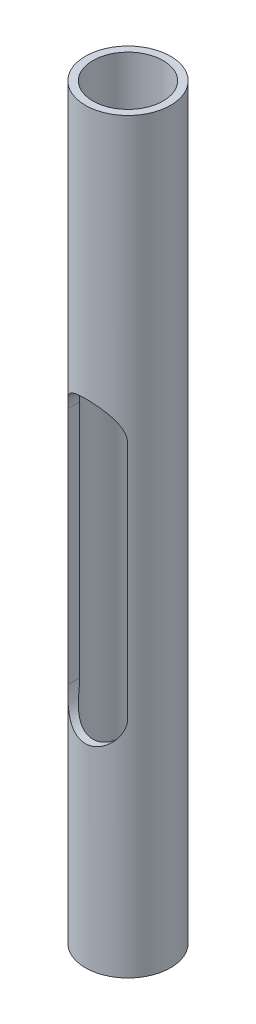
ISO-10303-21;
HEADER;
FILE_DESCRIPTION(('STEP AP214'),'2;1');
FILE_NAME('part.step','',(''),(''),'','','');
FILE_SCHEMA(('AUTOMOTIVE_DESIGN { 1 0 10303 214 1 1 1 1 }'));
ENDSEC;
DATA;
#1=APPLICATION_CONTEXT('core data for automotive mechanical design processes');
#2=APPLICATION_PROTOCOL_DEFINITION('international standard','automotive_design',2000,#1);
#3=PRODUCT_CONTEXT('',#1,'mechanical');
#4=PRODUCT('Part','Part','',(#3));
#5=PRODUCT_RELATED_PRODUCT_CATEGORY('part','',(#4));
#6=PRODUCT_DEFINITION_FORMATION('','',#4);
#7=PRODUCT_DEFINITION_CONTEXT('part definition',#1,'design');
#8=PRODUCT_DEFINITION('design','',#6,#7);
#9=PRODUCT_DEFINITION_SHAPE('','',#8);
#10=(LENGTH_UNIT() NAMED_UNIT(*) SI_UNIT(.MILLI.,.METRE.));
#11=(NAMED_UNIT(*) PLANE_ANGLE_UNIT() SI_UNIT($,.RADIAN.));
#12=(NAMED_UNIT(*) SI_UNIT($,.STERADIAN.) SOLID_ANGLE_UNIT());
#13=UNCERTAINTY_MEASURE_WITH_UNIT(LENGTH_MEASURE(1.E-05),#10,'distance_accuracy_value','');
#14=(GEOMETRIC_REPRESENTATION_CONTEXT(3) GLOBAL_UNCERTAINTY_ASSIGNED_CONTEXT((#13)) GLOBAL_UNIT_ASSIGNED_CONTEXT((#10,
#11,#12)) REPRESENTATION_CONTEXT('',''));
#15=CARTESIAN_POINT('',(0.,0.,0.));
#16=DIRECTION('',(0.,0.,1.));
#17=DIRECTION('',(1.,0.,0.));
#18=AXIS2_PLACEMENT_3D('',#15,#16,#17);
#19=CARTESIAN_POINT('',(0.,1000.,0.));
#20=DIRECTION('',(0.,-1.,0.));
#21=DIRECTION('',(0.,0.,-1.));
#22=AXIS2_PLACEMENT_3D('',#19,#20,#21);
#23=CYLINDRICAL_SURFACE('',#22,57.);
#24=CARTESIAN_POINT('',(0.,0.,0.));
#25=DIRECTION('',(0.,1.,0.));
#26=DIRECTION('',(0.,0.,1.));
#27=AXIS2_PLACEMENT_3D('',#24,#25,#26);
#28=CIRCLE('',#27,57.);
#29=CARTESIAN_POINT('',(0.,0.,57.));
#30=VERTEX_POINT('',#29);
#31=EDGE_CURVE('E36',#30,#30,#28,.T.);
#32=ORIENTED_EDGE('',*,*,#31,.T.);
#33=EDGE_LOOP('',(#32));
#34=FACE_BOUND('',#33,.T.);
#35=CARTESIAN_POINT('',(0.,1000.,0.));
#36=DIRECTION('',(0.,1.,0.));
#37=DIRECTION('',(0.,0.,1.));
#38=AXIS2_PLACEMENT_3D('',#35,#36,#37);
#39=CIRCLE('',#38,57.);
#40=CARTESIAN_POINT('',(0.,1000.,57.));
#41=VERTEX_POINT('',#40);
#42=EDGE_CURVE('E11',#41,#41,#39,.T.);
#43=ORIENTED_EDGE('',*,*,#42,.F.);
#44=EDGE_LOOP('',(#43));
#45=FACE_BOUND('',#44,.T.);
#46=CARTESIAN_POINT('',(-40.,620.,40.6078810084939));
#47=CARTESIAN_POINT('',(-40.0000187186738,620.483392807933,40.6078393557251));
#48=CARTESIAN_POINT('',(-39.9912379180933,620.966768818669,40.6165113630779));
#49=CARTESIAN_POINT('',(-39.9562189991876,621.932219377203,40.6509737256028));
#50=CARTESIAN_POINT('',(-39.9299830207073,622.414294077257,40.6767619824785));
#51=CARTESIAN_POINT('',(-39.860250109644,623.375239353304,40.7450944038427));
#52=CARTESIAN_POINT('',(-39.8167803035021,623.854113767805,40.7876122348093));
#53=CARTESIAN_POINT('',(-39.7128568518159,624.808265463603,40.8888030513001));
#54=CARTESIAN_POINT('',(-39.6524028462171,625.28354266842,40.9474763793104));
#55=CARTESIAN_POINT('',(-39.4475653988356,626.691955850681,41.1451803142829));
#56=CARTESIAN_POINT('',(-39.2789000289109,627.61858839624,41.3067025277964));
#57=CARTESIAN_POINT('',(-38.8796024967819,629.447415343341,41.6827454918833));
#58=CARTESIAN_POINT('',(-38.6489482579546,630.349600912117,41.8972851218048));
#59=CARTESIAN_POINT('',(-38.1309075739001,632.119350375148,42.369278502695));
#60=CARTESIAN_POINT('',(-37.8438853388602,632.987095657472,42.6264551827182));
#61=CARTESIAN_POINT('',(-37.2155911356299,634.690964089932,43.1760796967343));
#62=CARTESIAN_POINT('',(-36.8743227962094,635.527089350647,43.4685251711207));
#63=CARTESIAN_POINT('',(-36.1393390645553,637.168555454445,44.0814901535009));
#64=CARTESIAN_POINT('',(-35.745469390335,637.97379641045,44.4020912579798));
#65=CARTESIAN_POINT('',(-34.9084548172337,639.549836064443,45.0631142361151));
#66=CARTESIAN_POINT('',(-34.4653029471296,640.320629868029,45.403538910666));
#67=CARTESIAN_POINT('',(-33.4500380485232,641.958566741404,46.1580072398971));
#68=CARTESIAN_POINT('',(-32.8689226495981,642.819003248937,46.5745186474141));
#69=CARTESIAN_POINT('',(-31.6437412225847,644.489729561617,47.4154606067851));
#70=CARTESIAN_POINT('',(-30.9996706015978,645.300015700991,47.839891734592));
#71=CARTESIAN_POINT('',(-29.6500849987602,646.869009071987,48.6878615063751));
#72=CARTESIAN_POINT('',(-28.9445410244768,647.627691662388,49.1113996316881));
#73=CARTESIAN_POINT('',(-27.4738156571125,649.090638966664,49.949031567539));
#74=CARTESIAN_POINT('',(-26.7086301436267,649.794899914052,50.363124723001));
#75=CARTESIAN_POINT('',(-24.9864198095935,651.259605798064,51.2422113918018));
#76=CARTESIAN_POINT('',(-24.0187887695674,652.009540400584,51.7040334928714));
#77=CARTESIAN_POINT('',(-22.0071335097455,653.424506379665,52.5917692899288));
#78=CARTESIAN_POINT('',(-20.9630951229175,654.089521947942,53.0176762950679));
#79=CARTESIAN_POINT('',(-19.3446920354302,655.016697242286,53.6200919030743));
#80=CARTESIAN_POINT('',(-18.7968250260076,655.31388262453,53.8147230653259));
#81=CARTESIAN_POINT('',(-17.6841574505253,655.883995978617,54.1905449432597));
#82=CARTESIAN_POINT('',(-17.1193593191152,656.156927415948,54.3717375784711));
#83=CARTESIAN_POINT('',(-15.9738941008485,656.677381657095,54.7192179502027));
#84=CARTESIAN_POINT('',(-15.393231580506,656.924911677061,54.8855099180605));
#85=CARTESIAN_POINT('',(-14.2170853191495,657.393518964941,55.2018605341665));
#86=CARTESIAN_POINT('',(-13.6216029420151,657.614598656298,55.3519206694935));
#87=CARTESIAN_POINT('',(-12.1405785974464,658.124394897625,55.6993746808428));
#88=CARTESIAN_POINT('',(-11.2472931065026,658.39761270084,55.8869021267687));
#89=CARTESIAN_POINT('',(-9.43677619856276,658.882198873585,56.2209445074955));
#90=CARTESIAN_POINT('',(-8.51954905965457,659.093578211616,56.3674667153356));
#91=CARTESIAN_POINT('',(-6.6672418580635,659.451704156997,56.6164320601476));
#92=CARTESIAN_POINT('',(-5.73217395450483,659.598493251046,56.7189041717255));
#93=CARTESIAN_POINT('',(-3.85005162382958,659.825564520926,56.8776668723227));
#94=CARTESIAN_POINT('',(-2.90299679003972,659.905844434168,56.9339558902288));
#95=CARTESIAN_POINT('',(-1.0020499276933,659.998790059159,56.9991412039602));
#96=CARTESIAN_POINT('',(-0.0481480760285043,660.011321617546,57.0079434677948));
#97=CARTESIAN_POINT('',(1.8573422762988,659.968218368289,56.9776995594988));
#98=CARTESIAN_POINT('',(2.80893078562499,659.912583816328,56.9386535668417));
#99=CARTESIAN_POINT('',(4.70284822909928,659.733967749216,56.813591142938));
#100=CARTESIAN_POINT('',(5.64517492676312,659.610970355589,56.7275636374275));
#101=CARTESIAN_POINT('',(7.51360958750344,659.299398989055,56.5104440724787));
#102=CARTESIAN_POINT('',(8.43971754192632,659.110824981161,56.3793519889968));
#103=CARTESIAN_POINT('',(10.2483153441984,658.67579277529,56.0784529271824));
#104=CARTESIAN_POINT('',(11.1313187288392,658.430787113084,55.9096201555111));
#105=CARTESIAN_POINT('',(12.8712494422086,657.883541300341,55.5348804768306));
#106=CARTESIAN_POINT('',(13.7281773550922,657.581302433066,55.3289744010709));
#107=CARTESIAN_POINT('',(15.4120264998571,656.922714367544,54.8837676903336));
#108=CARTESIAN_POINT('',(16.2389459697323,656.566361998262,54.644465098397));
#109=CARTESIAN_POINT('',(17.8595627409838,655.802773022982,54.1364693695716));
#110=CARTESIAN_POINT('',(18.6532580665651,655.395533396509,53.8677744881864));
#111=CARTESIAN_POINT('',(20.2919590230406,654.484935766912,53.2736209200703));
#112=CARTESIAN_POINT('',(21.1327384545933,653.975920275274,52.9451756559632));
#113=CARTESIAN_POINT('',(22.7675461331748,652.902813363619,52.2630227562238));
#114=CARTESIAN_POINT('',(23.5615714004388,652.338718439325,51.9093135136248));
#115=CARTESIAN_POINT('',(25.1016839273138,651.158427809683,51.1823330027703));
#116=CARTESIAN_POINT('',(25.8477260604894,650.542184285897,50.8090439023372));
#117=CARTESIAN_POINT('',(27.289618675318,649.261014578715,50.0493845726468));
#118=CARTESIAN_POINT('',(27.9854667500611,648.596086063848,49.6630137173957));
#119=CARTESIAN_POINT('',(29.4459124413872,647.096520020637,48.8136632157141));
#120=CARTESIAN_POINT('',(30.2004737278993,646.252827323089,48.3493663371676));
#121=CARTESIAN_POINT('',(31.6360612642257,644.50387607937,47.4224611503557));
#122=CARTESIAN_POINT('',(32.3170722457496,643.598604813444,46.9598532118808));
#123=CARTESIAN_POINT('',(33.6029282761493,641.728578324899,46.0484987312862));
#124=CARTESIAN_POINT('',(34.2077604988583,640.763813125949,45.5997545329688));
#125=CARTESIAN_POINT('',(35.3374609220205,638.776826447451,44.7299868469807));
#126=CARTESIAN_POINT('',(35.8623544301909,637.754623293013,44.3089546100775));
#127=CARTESIAN_POINT('',(36.7162835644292,635.8967089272,43.6021477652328));
#128=CARTESIAN_POINT('',(37.0625860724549,635.072263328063,43.3075538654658));
#129=CARTESIAN_POINT('',(37.702293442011,633.391973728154,42.7518023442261));
#130=CARTESIAN_POINT('',(37.9956986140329,632.536129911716,42.4906445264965));
#131=CARTESIAN_POINT('',(38.5254559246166,630.798670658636,42.010911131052));
#132=CARTESIAN_POINT('',(38.7620006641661,629.917153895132,41.7921923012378));
#133=CARTESIAN_POINT('',(39.175864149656,628.129708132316,41.404497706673));
#134=CARTESIAN_POINT('',(39.353208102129,627.22378970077,41.2355007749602));
#135=CARTESIAN_POINT('',(39.5818880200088,625.792080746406,41.0156922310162));
#136=CARTESIAN_POINT('',(39.6544674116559,625.272531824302,40.9454608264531));
#137=CARTESIAN_POINT('',(39.7793024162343,624.228847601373,40.8241925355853));
#138=CARTESIAN_POINT('',(39.8315627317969,623.704713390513,40.7731512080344));
#139=CARTESIAN_POINT('',(39.9155352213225,622.651415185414,40.6909535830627));
#140=CARTESIAN_POINT('',(39.9471758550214,622.122240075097,40.6598665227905));
#141=CARTESIAN_POINT('',(39.9894258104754,621.062051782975,40.6182960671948));
#142=CARTESIAN_POINT('',(40.0000273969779,620.53103799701,40.6078202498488));
#143=CARTESIAN_POINT('',(40.,620.,40.6078810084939));
#144=B_SPLINE_CURVE_WITH_KNOTS('',3,(#46,#47,#48,#49,#50,#51,#52,#53,#54,#55,#56,#57,#58,#59,
#60,#61,#62,#63,#64,#65,#66,#67,#68,#69,#70,#71,#72,#73,#74,#75,#76,#77,#78,#79,#80,#81,#82,#83,
#84,#85,#86,#87,#88,#89,#90,#91,#92,#93,#94,#95,#96,#97,#98,#99,#100,#101,#102,#103,#104,#105,
#106,#107,#108,#109,#110,#111,#112,#113,#114,#115,#116,#117,#118,#119,#120,#121,#122,#123,#124,
#125,#126,#127,#128,#129,#130,#131,#132,#133,#134,#135,#136,#137,#138,#139,#140,#141,#142,#143),
.UNSPECIFIED.,.F.,.F.,(4,2,2,2,2,2,2,2,2,2,2,2,2,2,2,2,2,2,2,2,2,2,2,2,2,2,2,2,2,2,2,2,2,2,2,2,
2,2,2,2,2,2,2,2,2,2,2,2,4),(0.,1.44999242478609,2.89980712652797,4.34734878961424,
5.79492114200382,8.65728056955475,11.5206607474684,14.3661148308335,17.2113786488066,
20.065178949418,22.9193834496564,26.2724497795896,29.6257609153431,32.9806622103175,
36.3357954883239,40.2559312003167,44.1767956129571,46.1350119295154,48.0929479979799,
50.0503262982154,52.0075251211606,54.8625974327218,57.7171630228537,60.5698480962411,
63.4226302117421,66.2810592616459,69.1394775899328,71.9985699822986,74.8576639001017,
77.6500783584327,80.4424302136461,83.234945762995,86.0276271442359,89.1334603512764,
92.2394912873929,95.3484018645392,98.4574614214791,102.123849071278,105.790996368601,
109.458760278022,113.12536058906,115.947555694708,118.769734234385,121.582214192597,
124.393495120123,125.980665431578,127.567468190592,129.159747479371,130.752612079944),.UNSPECIFIED.);
#145=CARTESIAN_POINT('',(-40.0000000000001,620.,40.6078810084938));
#146=VERTEX_POINT('',#145);
#147=CARTESIAN_POINT('',(40.,620.,40.607881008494));
#148=VERTEX_POINT('',#147);
#149=EDGE_CURVE('E127',#146,#148,#144,.T.);
#150=ORIENTED_EDGE('',*,*,#149,.T.);
#151=DIRECTION('',(0.,-1.,0.));
#152=VECTOR('',#151,1.);
#153=CARTESIAN_POINT('',(40.,1000.,40.607881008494));
#154=LINE('',#153,#152);
#155=CARTESIAN_POINT('',(40.,300.,40.607881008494));
#156=VERTEX_POINT('',#155);
#157=EDGE_CURVE('E88',#148,#156,#154,.T.);
#158=ORIENTED_EDGE('',*,*,#157,.T.);
#159=CARTESIAN_POINT('',(40.,300.,40.6078810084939));
#160=CARTESIAN_POINT('',(40.0000187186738,299.516607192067,40.6078393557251));
#161=CARTESIAN_POINT('',(39.9912379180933,299.033231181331,40.6165113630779));
#162=CARTESIAN_POINT('',(39.9562189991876,298.067780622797,40.6509737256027));
#163=CARTESIAN_POINT('',(39.9299830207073,297.585705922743,40.6767619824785));
#164=CARTESIAN_POINT('',(39.860250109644,296.624760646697,40.7450944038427));
#165=CARTESIAN_POINT('',(39.8167803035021,296.145886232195,40.7876122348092));
#166=CARTESIAN_POINT('',(39.7128568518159,295.191734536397,40.8888030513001));
#167=CARTESIAN_POINT('',(39.6524028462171,294.71645733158,40.9474763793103));
#168=CARTESIAN_POINT('',(39.4475653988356,293.30804414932,41.1451803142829));
#169=CARTESIAN_POINT('',(39.2789000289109,292.38141160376,41.3067025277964));
#170=CARTESIAN_POINT('',(38.8796024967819,290.552584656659,41.6827454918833));
#171=CARTESIAN_POINT('',(38.6489482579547,289.650399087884,41.8972851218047));
#172=CARTESIAN_POINT('',(38.1309075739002,287.880649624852,42.3692785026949));
#173=CARTESIAN_POINT('',(37.8438853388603,287.012904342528,42.6264551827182));
#174=CARTESIAN_POINT('',(37.21559113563,285.309035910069,43.1760796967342));
#175=CARTESIAN_POINT('',(36.8743227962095,284.472910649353,43.4685251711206));
#176=CARTESIAN_POINT('',(36.1393390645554,282.831444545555,44.0814901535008));
#177=CARTESIAN_POINT('',(35.7454693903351,282.026203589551,44.4020912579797));
#178=CARTESIAN_POINT('',(34.9084548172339,280.450163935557,45.0631142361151));
#179=CARTESIAN_POINT('',(34.4653029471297,279.679370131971,45.4035389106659));
#180=CARTESIAN_POINT('',(33.4500380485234,278.041433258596,46.158007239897));
#181=CARTESIAN_POINT('',(32.8689226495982,277.180996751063,46.5745186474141));
#182=CARTESIAN_POINT('',(31.6437412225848,275.510270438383,47.4154606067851));
#183=CARTESIAN_POINT('',(30.9996706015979,274.699984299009,47.8398917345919));
#184=CARTESIAN_POINT('',(29.6500849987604,273.130990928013,48.687861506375));
#185=CARTESIAN_POINT('',(28.944541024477,272.372308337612,49.111399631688));
#186=CARTESIAN_POINT('',(27.4738156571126,270.909361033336,49.9490315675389));
#187=CARTESIAN_POINT('',(26.7086301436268,270.205100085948,50.3631247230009));
#188=CARTESIAN_POINT('',(24.9864198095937,268.740394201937,51.2422113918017));
#189=CARTESIAN_POINT('',(24.0187887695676,267.990459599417,51.7040334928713));
#190=CARTESIAN_POINT('',(22.0071335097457,266.575493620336,52.5917692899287));
#191=CARTESIAN_POINT('',(20.9630951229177,265.910478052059,53.0176762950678));
#192=CARTESIAN_POINT('',(19.3446920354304,264.983302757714,53.6200919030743));
#193=CARTESIAN_POINT('',(18.7968250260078,264.686117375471,53.8147230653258));
#194=CARTESIAN_POINT('',(17.6841574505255,264.116004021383,54.1905449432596));
#195=CARTESIAN_POINT('',(17.1193593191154,263.843072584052,54.371737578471));
#196=CARTESIAN_POINT('',(15.9738941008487,263.322618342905,54.7192179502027));
#197=CARTESIAN_POINT('',(15.3932315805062,263.075088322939,54.8855099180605));
#198=CARTESIAN_POINT('',(14.2170853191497,262.606481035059,55.2018605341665));
#199=CARTESIAN_POINT('',(13.6216029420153,262.385401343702,55.3519206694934));
#200=CARTESIAN_POINT('',(12.1405785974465,261.875605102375,55.6993746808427));
#201=CARTESIAN_POINT('',(11.2472931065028,261.60238729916,55.8869021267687));
#202=CARTESIAN_POINT('',(9.43677619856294,261.117801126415,56.2209445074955));
#203=CARTESIAN_POINT('',(8.51954905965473,260.906421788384,56.3674667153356));
#204=CARTESIAN_POINT('',(6.66724185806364,260.548295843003,56.6164320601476));
#205=CARTESIAN_POINT('',(5.73217395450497,260.401506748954,56.7189041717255));
#206=CARTESIAN_POINT('',(3.85005162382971,260.174435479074,56.8776668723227));
#207=CARTESIAN_POINT('',(2.90299679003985,260.094155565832,56.9339558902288));
#208=CARTESIAN_POINT('',(1.00204992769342,260.001209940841,56.9991412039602));
#209=CARTESIAN_POINT('',(0.0481480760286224,259.988678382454,57.0079434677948));
#210=CARTESIAN_POINT('',(-1.8573422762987,260.031781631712,56.9776995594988));
#211=CARTESIAN_POINT('',(-2.80893078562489,260.087416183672,56.9386535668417));
#212=CARTESIAN_POINT('',(-4.70284822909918,260.266032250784,56.813591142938));
#213=CARTESIAN_POINT('',(-5.64517492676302,260.389029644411,56.7275636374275));
#214=CARTESIAN_POINT('',(-7.51360958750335,260.700601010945,56.5104440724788));
#215=CARTESIAN_POINT('',(-8.43971754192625,260.889175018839,56.3793519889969));
#216=CARTESIAN_POINT('',(-10.2483153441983,261.32420722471,56.0784529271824));
#217=CARTESIAN_POINT('',(-11.1313187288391,261.569212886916,55.9096201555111));
#218=CARTESIAN_POINT('',(-12.8712494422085,262.116458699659,55.5348804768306));
#219=CARTESIAN_POINT('',(-13.7281773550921,262.418697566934,55.3289744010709));
#220=CARTESIAN_POINT('',(-15.412026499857,263.077285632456,54.8837676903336));
#221=CARTESIAN_POINT('',(-16.2389459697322,263.433638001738,54.644465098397));
#222=CARTESIAN_POINT('',(-17.8595627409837,264.197226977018,54.1364693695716));
#223=CARTESIAN_POINT('',(-18.653258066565,264.604466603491,53.8677744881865));
#224=CARTESIAN_POINT('',(-20.2919590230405,265.515064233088,53.2736209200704));
#225=CARTESIAN_POINT('',(-21.1327384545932,266.024079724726,52.9451756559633));
#226=CARTESIAN_POINT('',(-22.7675461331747,267.097186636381,52.2630227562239));
#227=CARTESIAN_POINT('',(-23.5615714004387,267.661281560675,51.9093135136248));
#228=CARTESIAN_POINT('',(-25.1016839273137,268.841572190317,51.1823330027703));
#229=CARTESIAN_POINT('',(-25.8477260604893,269.457815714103,50.8090439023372));
#230=CARTESIAN_POINT('',(-27.289618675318,270.738985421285,50.0493845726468));
#231=CARTESIAN_POINT('',(-27.9854667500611,271.403913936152,49.6630137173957));
#232=CARTESIAN_POINT('',(-29.4459124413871,272.903479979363,48.8136632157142));
#233=CARTESIAN_POINT('',(-30.2004737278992,273.747172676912,48.3493663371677));
#234=CARTESIAN_POINT('',(-31.6360612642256,275.49612392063,47.4224611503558));
#235=CARTESIAN_POINT('',(-32.3170722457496,276.401395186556,46.9598532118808));
#236=CARTESIAN_POINT('',(-33.6029282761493,278.271421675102,46.0484987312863));
#237=CARTESIAN_POINT('',(-34.2077604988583,279.236186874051,45.5997545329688));
#238=CARTESIAN_POINT('',(-35.3374609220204,281.223173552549,44.7299868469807));
#239=CARTESIAN_POINT('',(-35.8623544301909,282.245376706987,44.3089546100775));
#240=CARTESIAN_POINT('',(-36.7162835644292,284.1032910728,43.6021477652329));
#241=CARTESIAN_POINT('',(-37.0625860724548,284.927736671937,43.3075538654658));
#242=CARTESIAN_POINT('',(-37.702293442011,286.608026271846,42.7518023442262));
#243=CARTESIAN_POINT('',(-37.9956986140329,287.463870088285,42.4906445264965));
#244=CARTESIAN_POINT('',(-38.5254559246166,289.201329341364,42.0109111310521));
#245=CARTESIAN_POINT('',(-38.7620006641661,290.082846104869,41.7921923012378));
#246=CARTESIAN_POINT('',(-39.175864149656,291.870291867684,41.4044977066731));
#247=CARTESIAN_POINT('',(-39.353208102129,292.77621029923,41.2355007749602));
#248=CARTESIAN_POINT('',(-39.5818880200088,294.207919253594,41.0156922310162));
#249=CARTESIAN_POINT('',(-39.6544674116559,294.727468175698,40.9454608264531));
#250=CARTESIAN_POINT('',(-39.7793024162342,295.771152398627,40.8241925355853));
#251=CARTESIAN_POINT('',(-39.8315627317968,296.295286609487,40.7731512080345));
#252=CARTESIAN_POINT('',(-39.9155352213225,297.348584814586,40.6909535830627));
#253=CARTESIAN_POINT('',(-39.9471758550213,297.877759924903,40.6598665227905));
#254=CARTESIAN_POINT('',(-39.9894258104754,298.937948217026,40.6182960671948));
#255=CARTESIAN_POINT('',(-40.0000273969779,299.46896200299,40.6078202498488));
#256=CARTESIAN_POINT('',(-40.,300.,40.6078810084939));
#257=B_SPLINE_CURVE_WITH_KNOTS('',3,(#159,#160,#161,#162,#163,#164,#165,#166,#167,#168,#169,
#170,#171,#172,#173,#174,#175,#176,#177,#178,#179,#180,#181,#182,#183,#184,#185,#186,#187,#188,
#189,#190,#191,#192,#193,#194,#195,#196,#197,#198,#199,#200,#201,#202,#203,#204,#205,#206,#207,
#208,#209,#210,#211,#212,#213,#214,#215,#216,#217,#218,#219,#220,#221,#222,#223,#224,#225,#226,
#227,#228,#229,#230,#231,#232,#233,#234,#235,#236,#237,#238,#239,#240,#241,#242,#243,#244,#245,
#246,#247,#248,#249,#250,#251,#252,#253,#254,#255,#256),.UNSPECIFIED.,.F.,.F.,(4,2,2,2,2,2,2,2,
2,2,2,2,2,2,2,2,2,2,2,2,2,2,2,2,2,2,2,2,2,2,2,2,2,2,2,2,2,2,2,2,2,2,2,2,2,2,2,2,4),(0.,
1.44999242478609,2.89980712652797,4.34734878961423,5.79492114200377,8.65728056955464,
11.5206607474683,14.3661148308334,17.2113786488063,20.0651789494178,22.9193834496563,
26.2724497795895,29.625760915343,32.9806622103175,36.3357954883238,40.2559312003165,
44.1767956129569,46.1350119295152,48.0929479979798,50.0503262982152,52.0075251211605,
54.8625974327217,57.7171630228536,60.569848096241,63.422630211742,66.2810592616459,
69.1394775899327,71.9985699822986,74.8576639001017,77.6500783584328,80.4424302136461,
83.234945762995,86.0276271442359,89.1334603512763,92.2394912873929,95.3484018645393,
98.4574614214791,102.123849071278,105.790996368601,109.458760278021,113.12536058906,
115.947555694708,118.769734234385,121.582214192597,124.393495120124,125.980665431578,
127.567468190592,129.159747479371,130.752612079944),.UNSPECIFIED.);
#258=CARTESIAN_POINT('',(-40.,300.,40.6078810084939));
#259=VERTEX_POINT('',#258);
#260=EDGE_CURVE('E79',#156,#259,#257,.T.);
#261=ORIENTED_EDGE('',*,*,#260,.T.);
#262=DIRECTION('',(0.,-1.,0.));
#263=VECTOR('',#262,1.);
#264=CARTESIAN_POINT('',(-40.0000000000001,1000.,40.6078810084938));
#265=LINE('',#264,#263);
#266=EDGE_CURVE('E133',#259,#146,#265,.F.);
#267=ORIENTED_EDGE('',*,*,#266,.T.);
#268=EDGE_LOOP('',(#150,#158,#261,#267));
#269=FACE_BOUND('',#268,.T.);
#270=ADVANCED_FACE('F33',(#34,#45,#269),#23,.T.);
#271=CARTESIAN_POINT('',(0.,1000.,0.));
#272=DIRECTION('',(0.,-1.,0.));
#273=DIRECTION('',(0.,0.,-1.));
#274=AXIS2_PLACEMENT_3D('',#271,#272,#273);
#275=CYLINDRICAL_SURFACE('',#274,47.);
#276=CARTESIAN_POINT('',(0.,0.,0.));
#277=DIRECTION('',(0.,1.,0.));
#278=DIRECTION('',(0.,0.,1.));
#279=AXIS2_PLACEMENT_3D('',#276,#277,#278);
#280=CIRCLE('',#279,47.);
#281=CARTESIAN_POINT('',(0.,0.,47.));
#282=VERTEX_POINT('',#281);
#283=EDGE_CURVE('E138',#282,#282,#280,.T.);
#284=ORIENTED_EDGE('',*,*,#283,.F.);
#285=EDGE_LOOP('',(#284));
#286=FACE_BOUND('',#285,.T.);
#287=CARTESIAN_POINT('',(0.,1000.,0.));
#288=DIRECTION('',(0.,1.,0.));
#289=DIRECTION('',(0.,0.,1.));
#290=AXIS2_PLACEMENT_3D('',#287,#288,#289);
#291=CIRCLE('',#290,47.);
#292=CARTESIAN_POINT('',(0.,1000.,47.));
#293=VERTEX_POINT('',#292);
#294=EDGE_CURVE('E139',#293,#293,#291,.T.);
#295=ORIENTED_EDGE('',*,*,#294,.T.);
#296=EDGE_LOOP('',(#295));
#297=FACE_BOUND('',#296,.T.);
#298=DIRECTION('',(0.,-1.,0.));
#299=VECTOR('',#298,1.);
#300=CARTESIAN_POINT('',(40.,1000.,24.6779253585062));
#301=LINE('',#300,#299);
#302=CARTESIAN_POINT('',(40.,620.,24.6779253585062));
#303=VERTEX_POINT('',#302);
#304=CARTESIAN_POINT('',(40.,300.,24.6779253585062));
#305=VERTEX_POINT('',#304);
#306=EDGE_CURVE('E85',#303,#305,#301,.T.);
#307=ORIENTED_EDGE('',*,*,#306,.F.);
#308=CARTESIAN_POINT('',(-40.,620.,24.6779253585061));
#309=CARTESIAN_POINT('',(-40.0000114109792,620.344408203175,24.6778888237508));
#310=CARTESIAN_POINT('',(-39.9955521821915,620.688802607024,24.6851343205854));
#311=CARTESIAN_POINT('',(-39.9777786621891,621.376712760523,24.713917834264));
#312=CARTESIAN_POINT('',(-39.9644657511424,621.720228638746,24.7354536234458));
#313=CARTESIAN_POINT('',(-39.9291071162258,622.404939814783,24.7924881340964));
#314=CARTESIAN_POINT('',(-39.9070792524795,622.746138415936,24.8279582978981));
#315=CARTESIAN_POINT('',(-39.8544554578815,623.426185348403,24.9123430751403));
#316=CARTESIAN_POINT('',(-39.8238592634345,623.765033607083,24.961258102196));
#317=CARTESIAN_POINT('',(-39.7205851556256,624.766607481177,25.1255222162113));
#318=CARTESIAN_POINT('',(-39.6358500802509,625.425171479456,25.259330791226));
#319=CARTESIAN_POINT('',(-39.4357521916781,626.727265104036,25.5705985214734));
#320=CARTESIAN_POINT('',(-39.3203712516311,627.370785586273,25.7480835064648));
#321=CARTESIAN_POINT('',(-39.0065155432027,628.907197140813,26.2221808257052));
#322=CARTESIAN_POINT('',(-38.7934924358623,629.791351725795,26.5375229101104));
#323=CARTESIAN_POINT('',(-38.3149007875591,631.522861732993,27.2239474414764));
#324=CARTESIAN_POINT('',(-38.0493094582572,632.3702010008,27.5950540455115));
#325=CARTESIAN_POINT('',(-37.4670724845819,634.035785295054,28.3806199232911));
#326=CARTESIAN_POINT('',(-37.1500126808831,634.853722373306,28.7954203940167));
#327=CARTESIAN_POINT('',(-36.4692132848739,636.454576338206,29.65292918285));
#328=CARTESIAN_POINT('',(-36.1054753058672,637.237494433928,30.0956365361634));
#329=CARTESIAN_POINT('',(-35.4300894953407,638.577440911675,30.8853854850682));
#330=CARTESIAN_POINT('',(-35.1283128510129,639.141804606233,31.2285191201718));
#331=CARTESIAN_POINT('',(-34.4999251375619,640.252464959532,31.9213698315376));
#332=CARTESIAN_POINT('',(-34.1733118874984,640.798760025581,32.2710874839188));
#333=CARTESIAN_POINT('',(-33.4953979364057,641.873780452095,32.9741859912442));
#334=CARTESIAN_POINT('',(-33.1440869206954,642.402498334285,33.3275683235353));
#335=CARTESIAN_POINT('',(-32.4170323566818,643.44223570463,34.0351783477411));
#336=CARTESIAN_POINT('',(-32.0412895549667,643.953255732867,34.3894060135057));
#337=CARTESIAN_POINT('',(-31.2662909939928,644.956357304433,35.0954862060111));
#338=CARTESIAN_POINT('',(-30.8670927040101,645.448480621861,35.447342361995));
#339=CARTESIAN_POINT('',(-30.0444009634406,646.414704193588,36.1472799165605));
#340=CARTESIAN_POINT('',(-29.6209070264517,646.88880408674,36.4953612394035));
#341=CARTESIAN_POINT('',(-28.3141661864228,648.283042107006,37.5305439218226));
#342=CARTESIAN_POINT('',(-27.3941665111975,649.175758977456,38.2090394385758));
#343=CARTESIAN_POINT('',(-25.6694686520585,650.693523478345,39.3816577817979));
#344=CARTESIAN_POINT('',(-24.8837950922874,651.334309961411,39.8835573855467));
#345=CARTESIAN_POINT('',(-23.2532289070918,652.562692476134,40.8556952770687));
#346=CARTESIAN_POINT('',(-22.408338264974,653.150290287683,41.3259346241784));
#347=CARTESIAN_POINT('',(-20.6615070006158,654.266239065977,42.2263749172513));
#348=CARTESIAN_POINT('',(-19.7596295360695,654.794653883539,42.6566189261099));
#349=CARTESIAN_POINT('',(-17.9004272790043,655.786647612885,43.469568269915));
#350=CARTESIAN_POINT('',(-16.9431130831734,656.250238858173,43.8522826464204));
#351=CARTESIAN_POINT('',(-15.1531741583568,657.029124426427,44.4985137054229));
#352=CARTESIAN_POINT('',(-14.3288990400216,657.356110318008,44.7711045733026));
#353=CARTESIAN_POINT('',(-12.6490436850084,657.957836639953,45.2743872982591));
#354=CARTESIAN_POINT('',(-11.793466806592,658.232582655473,45.5050836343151));
#355=CARTESIAN_POINT('',(-10.0557023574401,658.725937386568,45.9203712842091));
#356=CARTESIAN_POINT('',(-9.17352654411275,658.944570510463,46.1049826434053));
#357=CARTESIAN_POINT('',(-7.3876421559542,659.322457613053,46.4246217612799));
#358=CARTESIAN_POINT('',(-6.48393333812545,659.481710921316,46.5596489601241));
#359=CARTESIAN_POINT('',(-4.65716974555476,659.738714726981,46.7777810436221));
#360=CARTESIAN_POINT('',(-3.73404399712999,659.836172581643,46.8606388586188));
#361=CARTESIAN_POINT('',(-1.87994398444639,659.966603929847,46.9715685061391));
#362=CARTESIAN_POINT('',(-0.948969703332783,659.999577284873,46.999640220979));
#363=CARTESIAN_POINT('',(0.912963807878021,660.000414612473,47.0003528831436));
#364=CARTESIAN_POINT('',(1.84392303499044,659.968282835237,46.9729974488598));
#365=CARTESIAN_POINT('',(3.69807590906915,659.839525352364,46.8634893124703));
#366=CARTESIAN_POINT('',(4.62126987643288,659.742902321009,46.7813388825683));
#367=CARTESIAN_POINT('',(6.38415644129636,659.496515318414,46.572211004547));
#368=CARTESIAN_POINT('',(7.22493936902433,659.351254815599,46.4490360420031));
#369=CARTESIAN_POINT('',(8.88832196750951,659.009212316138,46.1596180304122));
#370=CARTESIAN_POINT('',(9.71092274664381,658.812433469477,45.9933776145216));
#371=CARTESIAN_POINT('',(11.3335329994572,658.370018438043,45.6206545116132));
#372=CARTESIAN_POINT('',(12.1335413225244,658.124379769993,45.4141697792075));
#373=CARTESIAN_POINT('',(13.7073013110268,657.587249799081,44.9642062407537));
#374=CARTESIAN_POINT('',(14.4810513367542,657.29575563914,44.7207251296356));
#375=CARTESIAN_POINT('',(16.0591794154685,656.645426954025,44.1797714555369));
#376=CARTESIAN_POINT('',(16.8611753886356,656.28309813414,43.8795577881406));
#377=CARTESIAN_POINT('',(18.4286098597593,655.512661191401,43.2446699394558));
#378=CARTESIAN_POINT('',(19.1940474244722,655.104551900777,42.9099948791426));
#379=CARTESIAN_POINT('',(20.6869805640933,654.246032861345,42.2105291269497));
#380=CARTESIAN_POINT('',(21.4144563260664,653.795601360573,41.8457229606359));
#381=CARTESIAN_POINT('',(22.8301206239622,652.855860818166,41.0905019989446));
#382=CARTESIAN_POINT('',(23.5183012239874,652.366543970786,40.7000820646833));
#383=CARTESIAN_POINT('',(24.6866656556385,651.479564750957,39.9988615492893));
#384=CARTESIAN_POINT('',(25.1756595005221,651.08977057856,39.6927081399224));
#385=CARTESIAN_POINT('',(26.1310184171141,650.291210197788,39.0703847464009));
#386=CARTESIAN_POINT('',(26.5973871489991,649.882447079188,38.7542163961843));
#387=CARTESIAN_POINT('',(27.9631548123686,648.628491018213,37.7928705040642));
#388=CARTESIAN_POINT('',(28.8289226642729,647.755854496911,37.1350297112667));
#389=CARTESIAN_POINT('',(30.060551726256,646.395801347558,36.1337028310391));
#390=CARTESIAN_POINT('',(30.4603318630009,645.933390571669,35.7971167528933));
#391=CARTESIAN_POINT('',(31.2373917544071,644.991955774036,35.1210819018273));
#392=CARTESIAN_POINT('',(31.6146714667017,644.512931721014,34.7816331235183));
#393=CARTESIAN_POINT('',(32.3465810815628,643.53868815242,34.1020236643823));
#394=CARTESIAN_POINT('',(32.7012178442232,643.043473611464,33.7618632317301));
#395=CARTESIAN_POINT('',(33.3879065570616,642.036761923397,33.0829393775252));
#396=CARTESIAN_POINT('',(33.7199594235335,641.525265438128,32.7441758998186));
#397=CARTESIAN_POINT('',(34.5371109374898,640.201040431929,31.8858240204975));
#398=CARTESIAN_POINT('',(35.0064105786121,639.376781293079,31.3688315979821));
#399=CARTESIAN_POINT('',(35.8896493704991,637.687334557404,30.3543300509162));
#400=CARTESIAN_POINT('',(36.3035810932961,636.822141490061,29.8568235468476));
#401=CARTESIAN_POINT('',(37.0730315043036,635.050616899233,28.8958166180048));
#402=CARTESIAN_POINT('',(37.4286777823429,634.144380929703,28.4322431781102));
#403=CARTESIAN_POINT('',(38.0788677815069,632.286861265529,27.5553497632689));
#404=CARTESIAN_POINT('',(38.3734495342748,631.335606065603,27.141998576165));
#405=CARTESIAN_POINT('',(38.801481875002,629.73957483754,26.5241634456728));
#406=CARTESIAN_POINT('',(38.9546763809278,629.108380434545,26.2982062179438));
#407=CARTESIAN_POINT('',(39.2320780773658,627.82771791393,25.8825510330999));
#408=CARTESIAN_POINT('',(39.3562842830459,627.178249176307,25.6928543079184));
#409=CARTESIAN_POINT('',(39.5732191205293,625.865274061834,25.3574492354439));
#410=CARTESIAN_POINT('',(39.6660570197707,625.2018251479,25.2115883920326));
#411=CARTESIAN_POINT('',(39.818783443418,623.862397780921,24.9696843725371));
#412=CARTESIAN_POINT('',(39.8786942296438,623.18642811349,24.8736075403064));
#413=CARTESIAN_POINT('',(39.9474764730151,622.091099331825,24.7629063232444));
#414=CARTESIAN_POINT('',(39.9671342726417,621.674074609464,24.7311387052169));
#415=CARTESIAN_POINT('',(39.9934133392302,620.838061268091,24.6886025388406));
#416=CARTESIAN_POINT('',(40.0000193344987,620.419070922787,24.6778585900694));
#417=CARTESIAN_POINT('',(40.,620.,24.6779253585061));
#418=B_SPLINE_CURVE_WITH_KNOTS('',3,(#308,#309,#310,#311,#312,#313,#314,#315,#316,#317,#318,
#319,#320,#321,#322,#323,#324,#325,#326,#327,#328,#329,#330,#331,#332,#333,#334,#335,#336,#337,
#338,#339,#340,#341,#342,#343,#344,#345,#346,#347,#348,#349,#350,#351,#352,#353,#354,#355,#356,
#357,#358,#359,#360,#361,#362,#363,#364,#365,#366,#367,#368,#369,#370,#371,#372,#373,#374,#375,
#376,#377,#378,#379,#380,#381,#382,#383,#384,#385,#386,#387,#388,#389,#390,#391,#392,#393,#394,
#395,#396,#397,#398,#399,#400,#401,#402,#403,#404,#405,#406,#407,#408,#409,#410,#411,#412,#413,
#414,#415,#416,#417),.UNSPECIFIED.,.F.,.F.,(4,2,2,2,2,2,2,2,2,2,2,2,2,2,2,2,2,2,2,2,2,2,2,2,2,2,
2,2,2,2,2,2,2,2,2,2,2,2,2,2,2,2,2,2,2,2,2,2,2,2,2,2,2,2,4),(0.,1.03309644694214,
2.06603188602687,3.09686133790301,4.12772250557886,6.15697208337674,8.18742463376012,
11.0703542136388,13.9545362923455,16.8631959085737,19.7717550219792,21.9495985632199,
24.1276335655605,26.3065836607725,28.4854672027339,30.6592184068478,32.8330131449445,
37.1778270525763,40.5688415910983,43.9597426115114,47.3469493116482,50.7335106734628,
53.5139440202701,56.2940799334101,59.0730044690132,61.8519603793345,64.6439801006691,
67.4360058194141,70.2278492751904,73.0195769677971,75.6029826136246,78.1862303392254,
80.7696093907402,83.3531494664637,86.1400180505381,88.9269577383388,91.7153377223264,
94.5042788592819,96.5923629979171,98.6801082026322,102.856820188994,104.949841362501,
107.042866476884,109.135254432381,111.227557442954,114.465959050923,117.704794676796,
120.936442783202,124.166072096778,126.227668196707,128.289334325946,130.34374303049,
132.396761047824,133.652166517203,134.909040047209),.UNSPECIFIED.);
#419=CARTESIAN_POINT('',(-40.,620.,24.677925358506));
#420=VERTEX_POINT('',#419);
#421=EDGE_CURVE('E55',#420,#303,#418,.T.);
#422=ORIENTED_EDGE('',*,*,#421,.F.);
#423=DIRECTION('',(0.,-1.,0.));
#424=VECTOR('',#423,1.);
#425=CARTESIAN_POINT('',(-40.0000000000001,1000.,24.677925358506));
#426=LINE('',#425,#424);
#427=CARTESIAN_POINT('',(-40.,300.,24.6779253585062));
#428=VERTEX_POINT('',#427);
#429=EDGE_CURVE('E93',#428,#420,#426,.F.);
#430=ORIENTED_EDGE('',*,*,#429,.F.);
#431=CARTESIAN_POINT('',(40.,300.,24.6779253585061));
#432=CARTESIAN_POINT('',(40.0000114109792,299.655591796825,24.6778888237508));
#433=CARTESIAN_POINT('',(39.9955521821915,299.311197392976,24.6851343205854));
#434=CARTESIAN_POINT('',(39.9777786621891,298.623287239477,24.713917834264));
#435=CARTESIAN_POINT('',(39.9644657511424,298.279771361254,24.7354536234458));
#436=CARTESIAN_POINT('',(39.9291071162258,297.595060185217,24.7924881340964));
#437=CARTESIAN_POINT('',(39.9070792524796,297.253861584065,24.8279582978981));
#438=CARTESIAN_POINT('',(39.8544554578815,296.573814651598,24.9123430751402));
#439=CARTESIAN_POINT('',(39.8238592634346,296.234966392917,24.961258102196));
#440=CARTESIAN_POINT('',(39.7205851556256,295.233392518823,25.1255222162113));
#441=CARTESIAN_POINT('',(39.6358500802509,294.574828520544,25.2593307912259));
#442=CARTESIAN_POINT('',(39.4357521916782,293.272734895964,25.5705985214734));
#443=CARTESIAN_POINT('',(39.3203712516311,292.629214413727,25.7480835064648));
#444=CARTESIAN_POINT('',(39.0065155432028,291.092802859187,26.2221808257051));
#445=CARTESIAN_POINT('',(38.7934924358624,290.208648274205,26.5375229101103));
#446=CARTESIAN_POINT('',(38.3149007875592,288.477138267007,27.2239474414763));
#447=CARTESIAN_POINT('',(38.0493094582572,287.6297989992,27.5950540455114));
#448=CARTESIAN_POINT('',(37.467072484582,285.964214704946,28.380619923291));
#449=CARTESIAN_POINT('',(37.1500126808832,285.146277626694,28.7954203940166));
#450=CARTESIAN_POINT('',(36.4692132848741,283.545423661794,29.6529291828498));
#451=CARTESIAN_POINT('',(36.1054753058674,282.762505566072,30.0956365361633));
#452=CARTESIAN_POINT('',(35.4300894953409,281.422559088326,30.885385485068));
#453=CARTESIAN_POINT('',(35.128312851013,280.858195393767,31.2285191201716));
#454=CARTESIAN_POINT('',(34.499925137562,279.747535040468,31.9213698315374));
#455=CARTESIAN_POINT('',(34.1733118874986,279.201239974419,32.2710874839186));
#456=CARTESIAN_POINT('',(33.495397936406,278.126219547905,32.974185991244));
#457=CARTESIAN_POINT('',(33.1440869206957,277.597501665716,33.3275683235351));
#458=CARTESIAN_POINT('',(32.417032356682,276.557764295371,34.0351783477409));
#459=CARTESIAN_POINT('',(32.041289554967,276.046744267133,34.3894060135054));
#460=CARTESIAN_POINT('',(31.2662909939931,275.043642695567,35.0954862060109));
#461=CARTESIAN_POINT('',(30.8670927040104,274.55151937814,35.4473423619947));
#462=CARTESIAN_POINT('',(30.0444009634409,273.585295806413,36.1472799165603));
#463=CARTESIAN_POINT('',(29.620907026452,273.111195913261,36.4953612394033));
#464=CARTESIAN_POINT('',(28.3141661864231,271.716957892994,37.5305439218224));
#465=CARTESIAN_POINT('',(27.3941665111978,270.824241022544,38.2090394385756));
#466=CARTESIAN_POINT('',(25.6694686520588,269.306476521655,39.3816577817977));
#467=CARTESIAN_POINT('',(24.8837950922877,268.665690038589,39.8835573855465));
#468=CARTESIAN_POINT('',(23.2532289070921,267.437307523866,40.8556952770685));
#469=CARTESIAN_POINT('',(22.4083382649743,266.849709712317,41.3259346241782));
#470=CARTESIAN_POINT('',(20.6615070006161,265.733760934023,42.2263749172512));
#471=CARTESIAN_POINT('',(19.7596295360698,265.205346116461,42.6566189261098));
#472=CARTESIAN_POINT('',(17.9004272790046,264.213352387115,43.4695682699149));
#473=CARTESIAN_POINT('',(16.9431130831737,263.749761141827,43.8522826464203));
#474=CARTESIAN_POINT('',(15.1531741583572,262.970875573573,44.4985137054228));
#475=CARTESIAN_POINT('',(14.328899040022,262.643889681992,44.7711045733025));
#476=CARTESIAN_POINT('',(12.6490436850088,262.042163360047,45.274387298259));
#477=CARTESIAN_POINT('',(11.7934668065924,261.767417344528,45.505083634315));
#478=CARTESIAN_POINT('',(10.0557023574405,261.274062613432,45.920371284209));
#479=CARTESIAN_POINT('',(9.17352654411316,261.055429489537,46.1049826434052));
#480=CARTESIAN_POINT('',(7.3876421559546,260.677542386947,46.4246217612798));
#481=CARTESIAN_POINT('',(6.48393333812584,260.518289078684,46.5596489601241));
#482=CARTESIAN_POINT('',(4.65716974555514,260.261285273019,46.7777810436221));
#483=CARTESIAN_POINT('',(3.73404399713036,260.163827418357,46.8606388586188));
#484=CARTESIAN_POINT('',(1.87994398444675,260.033396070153,46.9715685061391));
#485=CARTESIAN_POINT('',(0.948969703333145,260.000422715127,46.999640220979));
#486=CARTESIAN_POINT('',(-0.91296380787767,259.999585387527,47.0003528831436));
#487=CARTESIAN_POINT('',(-1.8439230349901,260.031717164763,46.9729974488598));
#488=CARTESIAN_POINT('',(-3.69807590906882,260.160474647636,46.8634893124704));
#489=CARTESIAN_POINT('',(-4.62126987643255,260.257097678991,46.7813388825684));
#490=CARTESIAN_POINT('',(-6.38415644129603,260.503484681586,46.5722110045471));
#491=CARTESIAN_POINT('',(-7.224939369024,260.648745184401,46.4490360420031));
#492=CARTESIAN_POINT('',(-8.88832196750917,260.990787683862,46.1596180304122));
#493=CARTESIAN_POINT('',(-9.71092274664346,261.187566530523,45.9933776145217));
#494=CARTESIAN_POINT('',(-11.3335329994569,261.629981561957,45.6206545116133));
#495=CARTESIAN_POINT('',(-12.1335413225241,261.875620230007,45.4141697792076));
#496=CARTESIAN_POINT('',(-13.7073013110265,262.412750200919,44.9642062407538));
#497=CARTESIAN_POINT('',(-14.4810513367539,262.70424436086,44.7207251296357));
#498=CARTESIAN_POINT('',(-16.0591794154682,263.354573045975,44.179771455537));
#499=CARTESIAN_POINT('',(-16.8611753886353,263.71690186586,43.8795577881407));
#500=CARTESIAN_POINT('',(-18.428609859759,264.487338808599,43.2446699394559));
#501=CARTESIAN_POINT('',(-19.1940474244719,264.895448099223,42.9099948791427));
#502=CARTESIAN_POINT('',(-20.686980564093,265.753967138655,42.2105291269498));
#503=CARTESIAN_POINT('',(-21.4144563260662,266.204398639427,41.845722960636));
#504=CARTESIAN_POINT('',(-22.830120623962,267.144139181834,41.0905019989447));
#505=CARTESIAN_POINT('',(-23.5183012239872,267.633456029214,40.7000820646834));
#506=CARTESIAN_POINT('',(-24.6866656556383,268.520435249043,39.9988615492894));
#507=CARTESIAN_POINT('',(-25.1756595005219,268.91022942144,39.6927081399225));
#508=CARTESIAN_POINT('',(-26.1310184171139,269.708789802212,39.070384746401));
#509=CARTESIAN_POINT('',(-26.5973871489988,270.117552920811,38.7542163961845));
#510=CARTESIAN_POINT('',(-27.9631548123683,271.371508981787,37.7928705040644));
#511=CARTESIAN_POINT('',(-28.8289226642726,272.244145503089,37.1350297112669));
#512=CARTESIAN_POINT('',(-30.0605517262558,273.604198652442,36.1337028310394));
#513=CARTESIAN_POINT('',(-30.4603318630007,274.066609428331,35.7971167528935));
#514=CARTESIAN_POINT('',(-31.2373917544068,275.008044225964,35.1210819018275));
#515=CARTESIAN_POINT('',(-31.6146714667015,275.487068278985,34.7816331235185));
#516=CARTESIAN_POINT('',(-32.3465810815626,276.461311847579,34.1020236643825));
#517=CARTESIAN_POINT('',(-32.701217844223,276.956526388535,33.7618632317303));
#518=CARTESIAN_POINT('',(-33.3879065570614,277.963238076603,33.0829393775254));
#519=CARTESIAN_POINT('',(-33.7199594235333,278.474734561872,32.7441758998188));
#520=CARTESIAN_POINT('',(-34.5371109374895,279.798959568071,31.8858240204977));
#521=CARTESIAN_POINT('',(-35.0064105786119,280.623218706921,31.3688315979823));
#522=CARTESIAN_POINT('',(-35.889649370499,282.312665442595,30.3543300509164));
#523=CARTESIAN_POINT('',(-36.303581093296,283.177858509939,29.8568235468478));
#524=CARTESIAN_POINT('',(-37.0730315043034,284.949383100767,28.895816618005));
#525=CARTESIAN_POINT('',(-37.4286777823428,285.855619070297,28.4322431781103));
#526=CARTESIAN_POINT('',(-38.0788677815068,287.713138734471,27.555349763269));
#527=CARTESIAN_POINT('',(-38.3734495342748,288.664393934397,27.1419985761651));
#528=CARTESIAN_POINT('',(-38.8014818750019,290.260425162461,26.5241634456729));
#529=CARTESIAN_POINT('',(-38.9546763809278,290.891619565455,26.2982062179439));
#530=CARTESIAN_POINT('',(-39.2320780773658,292.17228208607,25.8825510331));
#531=CARTESIAN_POINT('',(-39.3562842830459,292.821750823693,25.6928543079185));
#532=CARTESIAN_POINT('',(-39.5732191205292,294.134725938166,25.3574492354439));
#533=CARTESIAN_POINT('',(-39.6660570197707,294.798174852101,25.2115883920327));
#534=CARTESIAN_POINT('',(-39.8187834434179,296.137602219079,24.9696843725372));
#535=CARTESIAN_POINT('',(-39.8786942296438,296.813571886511,24.8736075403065));
#536=CARTESIAN_POINT('',(-39.9474764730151,297.908900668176,24.7629063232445));
#537=CARTESIAN_POINT('',(-39.9671342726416,298.325925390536,24.7311387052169));
#538=CARTESIAN_POINT('',(-39.9934133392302,299.161938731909,24.6886025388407));
#539=CARTESIAN_POINT('',(-40.0000193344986,299.580929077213,24.6778585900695));
#540=CARTESIAN_POINT('',(-40.,300.,24.6779253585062));
#541=B_SPLINE_CURVE_WITH_KNOTS('',3,(#431,#432,#433,#434,#435,#436,#437,#438,#439,#440,#441,
#442,#443,#444,#445,#446,#447,#448,#449,#450,#451,#452,#453,#454,#455,#456,#457,#458,#459,#460,
#461,#462,#463,#464,#465,#466,#467,#468,#469,#470,#471,#472,#473,#474,#475,#476,#477,#478,#479,
#480,#481,#482,#483,#484,#485,#486,#487,#488,#489,#490,#491,#492,#493,#494,#495,#496,#497,#498,
#499,#500,#501,#502,#503,#504,#505,#506,#507,#508,#509,#510,#511,#512,#513,#514,#515,#516,#517,
#518,#519,#520,#521,#522,#523,#524,#525,#526,#527,#528,#529,#530,#531,#532,#533,#534,#535,#536,
#537,#538,#539,#540),.UNSPECIFIED.,.F.,.F.,(4,2,2,2,2,2,2,2,2,2,2,2,2,2,2,2,2,2,2,2,2,2,2,2,2,2,
2,2,2,2,2,2,2,2,2,2,2,2,2,2,2,2,2,2,2,2,2,2,2,2,2,2,2,2,4),(0.,1.03309644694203,
2.06603188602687,3.09686133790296,4.12772250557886,6.15697208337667,8.18742463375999,
11.0703542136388,13.9545362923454,16.8631959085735,19.7717550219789,21.9495985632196,
24.1276335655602,26.3065836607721,28.4854672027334,30.6592184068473,32.8330131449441,
37.1778270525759,40.568841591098,43.9597426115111,47.346949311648,50.7335106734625,
53.5139440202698,56.2940799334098,59.0730044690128,61.8519603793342,64.6439801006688,
67.4360058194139,70.2278492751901,73.0195769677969,75.6029826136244,78.1862303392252,
80.7696093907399,83.3531494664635,86.1400180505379,88.9269577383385,91.7153377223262,
94.5042788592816,96.5923629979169,98.6801082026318,102.856820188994,104.949841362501,
107.042866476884,109.135254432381,111.227557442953,114.465959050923,117.704794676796,
120.936442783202,124.166072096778,126.227668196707,128.289334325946,130.34374303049,
132.396761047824,133.652166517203,134.909040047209),.UNSPECIFIED.);
#542=EDGE_CURVE('E76',#305,#428,#541,.T.);
#543=ORIENTED_EDGE('',*,*,#542,.F.);
#544=EDGE_LOOP('',(#307,#422,#430,#543));
#545=FACE_BOUND('',#544,.T.);
#546=ADVANCED_FACE('F91',(#286,#297,#545),#275,.F.);
#547=CARTESIAN_POINT('',(0.,1000.,0.));
#548=DIRECTION('',(0.,1.,0.));
#549=DIRECTION('',(0.,0.,1.));
#550=AXIS2_PLACEMENT_3D('',#547,#548,#549);
#551=PLANE('',#550);
#552=ORIENTED_EDGE('',*,*,#294,.F.);
#553=EDGE_LOOP('',(#552));
#554=FACE_BOUND('',#553,.T.);
#555=ORIENTED_EDGE('',*,*,#42,.T.);
#556=EDGE_LOOP('',(#555));
#557=FACE_BOUND('',#556,.T.);
#558=ADVANCED_FACE('F149',(#554,#557),#551,.T.);
#559=CARTESIAN_POINT('',(0.,0.,0.));
#560=DIRECTION('',(0.,1.,0.));
#561=DIRECTION('',(0.,0.,1.));
#562=AXIS2_PLACEMENT_3D('',#559,#560,#561);
#563=PLANE('',#562);
#564=ORIENTED_EDGE('',*,*,#283,.T.);
#565=EDGE_LOOP('',(#564));
#566=FACE_BOUND('',#565,.T.);
#567=ORIENTED_EDGE('',*,*,#31,.F.);
#568=EDGE_LOOP('',(#567));
#569=FACE_BOUND('',#568,.T.);
#570=ADVANCED_FACE('F123',(#566,#569),#563,.F.);
#571=CARTESIAN_POINT('',(0.,620.,57.001));
#572=DIRECTION('',(0.,0.,-1.));
#573=DIRECTION('',(-1.,0.,0.));
#574=AXIS2_PLACEMENT_3D('',#571,#572,#573);
#575=CYLINDRICAL_SURFACE('',#574,40.);
#576=DIRECTION('',(0.,0.,-1.));
#577=VECTOR('',#576,1.);
#578=CARTESIAN_POINT('',(-40.,620.,57.001));
#579=LINE('',#578,#577);
#580=EDGE_CURVE('E89',#146,#420,#579,.T.);
#581=ORIENTED_EDGE('',*,*,#580,.T.);
#582=ORIENTED_EDGE('',*,*,#421,.T.);
#583=DIRECTION('',(0.,0.,-1.));
#584=VECTOR('',#583,1.);
#585=CARTESIAN_POINT('',(40.,620.,57.001));
#586=LINE('',#585,#584);
#587=EDGE_CURVE('E82',#148,#303,#586,.T.);
#588=ORIENTED_EDGE('',*,*,#587,.F.);
#589=ORIENTED_EDGE('',*,*,#149,.F.);
#590=EDGE_LOOP('',(#581,#582,#588,#589));
#591=FACE_BOUND('',#590,.T.);
#592=ADVANCED_FACE('F118',(#591),#575,.F.);
#593=CARTESIAN_POINT('',(-40.,620.,57.001));
#594=DIRECTION('',(1.,0.,0.));
#595=DIRECTION('',(0.,1.,0.));
#596=AXIS2_PLACEMENT_3D('',#593,#594,#595);
#597=PLANE('',#596);
#598=DIRECTION('',(0.,0.,-1.));
#599=VECTOR('',#598,1.);
#600=CARTESIAN_POINT('',(-40.,300.,57.001));
#601=LINE('',#600,#599);
#602=EDGE_CURVE('E81',#259,#428,#601,.T.);
#603=ORIENTED_EDGE('',*,*,#602,.T.);
#604=ORIENTED_EDGE('',*,*,#429,.T.);
#605=ORIENTED_EDGE('',*,*,#580,.F.);
#606=ORIENTED_EDGE('',*,*,#266,.F.);
#607=EDGE_LOOP('',(#603,#604,#605,#606));
#608=FACE_BOUND('',#607,.T.);
#609=ADVANCED_FACE('F122',(#608),#597,.T.);
#610=CARTESIAN_POINT('',(0.,300.,57.001));
#611=DIRECTION('',(0.,0.,-1.));
#612=DIRECTION('',(-1.,0.,0.));
#613=AXIS2_PLACEMENT_3D('',#610,#611,#612);
#614=CYLINDRICAL_SURFACE('',#613,40.);
#615=DIRECTION('',(0.,0.,-1.));
#616=VECTOR('',#615,1.);
#617=CARTESIAN_POINT('',(40.,300.,57.001));
#618=LINE('',#617,#616);
#619=EDGE_CURVE('E47',#156,#305,#618,.T.);
#620=ORIENTED_EDGE('',*,*,#619,.T.);
#621=ORIENTED_EDGE('',*,*,#542,.T.);
#622=ORIENTED_EDGE('',*,*,#602,.F.);
#623=ORIENTED_EDGE('',*,*,#260,.F.);
#624=EDGE_LOOP('',(#620,#621,#622,#623));
#625=FACE_BOUND('',#624,.T.);
#626=ADVANCED_FACE('F73',(#625),#614,.F.);
#627=CARTESIAN_POINT('',(40.,620.,57.001));
#628=DIRECTION('',(-1.,0.,0.));
#629=DIRECTION('',(0.,-1.,0.));
#630=AXIS2_PLACEMENT_3D('',#627,#628,#629);
#631=PLANE('',#630);
#632=ORIENTED_EDGE('',*,*,#587,.T.);
#633=ORIENTED_EDGE('',*,*,#306,.T.);
#634=ORIENTED_EDGE('',*,*,#619,.F.);
#635=ORIENTED_EDGE('',*,*,#157,.F.);
#636=EDGE_LOOP('',(#632,#633,#634,#635));
#637=FACE_BOUND('',#636,.T.);
#638=ADVANCED_FACE('F86',(#637),#631,.T.);
#639=CLOSED_SHELL('',(#270,#546,#558,#570,#592,#609,#626,#638));
#640=MANIFOLD_SOLID_BREP('B2',#639);
#641=ADVANCED_BREP_SHAPE_REPRESENTATION('',(#18,#640),#14);
#642=SHAPE_DEFINITION_REPRESENTATION(#9,#641);
ENDSEC;
END-ISO-10303-21;
